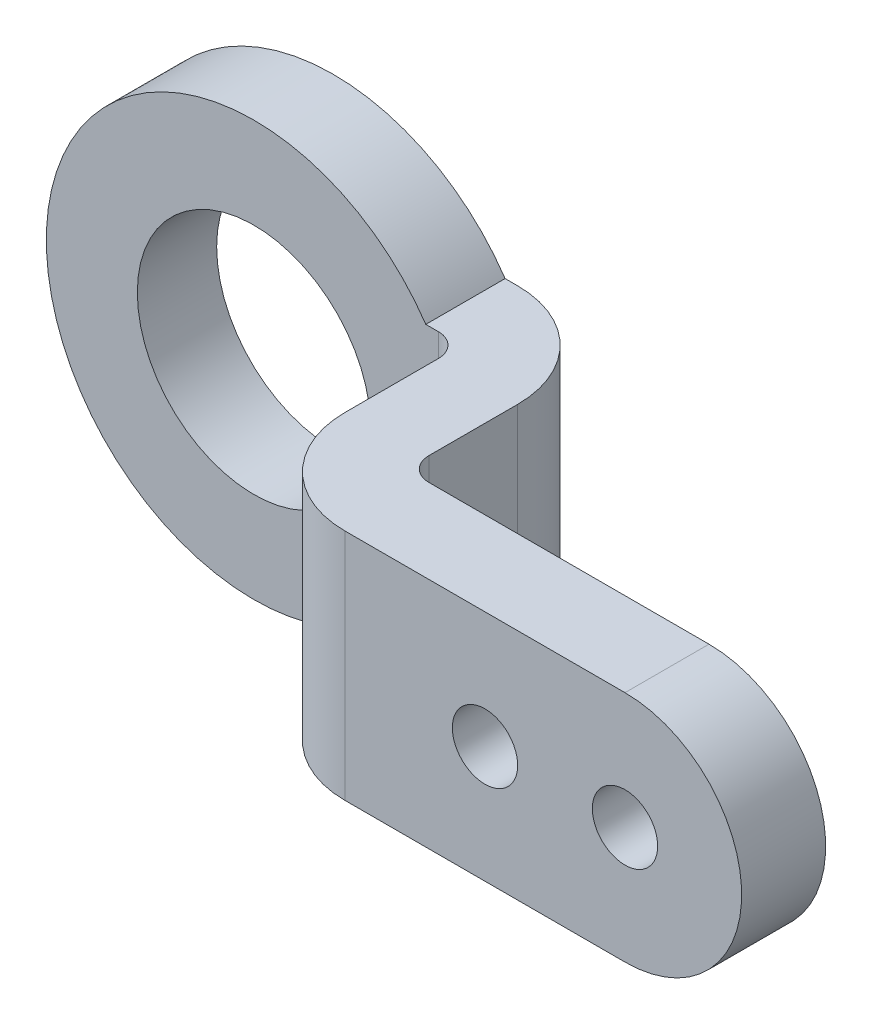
ISO-10303-21;
HEADER;
FILE_DESCRIPTION(('STEP AP214'),'2;1');
FILE_NAME('part.step','',(''),(''),'','','');
FILE_SCHEMA(('AUTOMOTIVE_DESIGN { 1 0 10303 214 1 1 1 1 }'));
ENDSEC;
DATA;
#1=APPLICATION_CONTEXT('core data for automotive mechanical design processes');
#2=APPLICATION_PROTOCOL_DEFINITION('international standard','automotive_design',2000,#1);
#3=PRODUCT_CONTEXT('',#1,'mechanical');
#4=PRODUCT('Part','Part','',(#3));
#5=PRODUCT_RELATED_PRODUCT_CATEGORY('part','',(#4));
#6=PRODUCT_DEFINITION_FORMATION('','',#4);
#7=PRODUCT_DEFINITION_CONTEXT('part definition',#1,'design');
#8=PRODUCT_DEFINITION('design','',#6,#7);
#9=PRODUCT_DEFINITION_SHAPE('','',#8);
#10=(LENGTH_UNIT() NAMED_UNIT(*) SI_UNIT(.MILLI.,.METRE.));
#11=(NAMED_UNIT(*) PLANE_ANGLE_UNIT() SI_UNIT($,.RADIAN.));
#12=(NAMED_UNIT(*) SI_UNIT($,.STERADIAN.) SOLID_ANGLE_UNIT());
#13=UNCERTAINTY_MEASURE_WITH_UNIT(LENGTH_MEASURE(1.E-05),#10,'distance_accuracy_value','');
#14=(GEOMETRIC_REPRESENTATION_CONTEXT(3) GLOBAL_UNCERTAINTY_ASSIGNED_CONTEXT((#13)) GLOBAL_UNIT_ASSIGNED_CONTEXT((#10,
#11,#12)) REPRESENTATION_CONTEXT('',''));
#15=CARTESIAN_POINT('',(0.,0.,0.));
#16=DIRECTION('',(0.,0.,1.));
#17=DIRECTION('',(1.,0.,0.));
#18=AXIS2_PLACEMENT_3D('',#15,#16,#17);
#19=CARTESIAN_POINT('',(-8.2,2.5,-1.8));
#20=DIRECTION('',(-1.,0.,0.));
#21=DIRECTION('',(0.,-1.,0.));
#22=AXIS2_PLACEMENT_3D('',#19,#20,#21);
#23=PLANE('',#22);
#24=DIRECTION('',(0.,0.,1.));
#25=VECTOR('',#24,1.);
#26=CARTESIAN_POINT('',(-8.2,2.5,-1.8));
#27=LINE('',#26,#25);
#28=CARTESIAN_POINT('',(-8.2,2.5,-4.2));
#29=VERTEX_POINT('',#28);
#30=CARTESIAN_POINT('',(-8.2,2.5,-2.2));
#31=VERTEX_POINT('',#30);
#32=EDGE_CURVE('E522',#29,#31,#27,.T.);
#33=ORIENTED_EDGE('',*,*,#32,.F.);
#34=DIRECTION('',(0.,-1.,0.));
#35=VECTOR('',#34,1.);
#36=CARTESIAN_POINT('',(-8.2,2.5,-4.2));
#37=LINE('',#36,#35);
#38=CARTESIAN_POINT('',(-8.2,-2.5,-4.2));
#39=VERTEX_POINT('',#38);
#40=EDGE_CURVE('E549',#29,#39,#37,.T.);
#41=ORIENTED_EDGE('',*,*,#40,.T.);
#42=DIRECTION('',(0.,0.,1.));
#43=VECTOR('',#42,1.);
#44=CARTESIAN_POINT('',(-8.2,-2.5,-1.8));
#45=LINE('',#44,#43);
#46=CARTESIAN_POINT('',(-8.2,-2.5,-2.2));
#47=VERTEX_POINT('',#46);
#48=EDGE_CURVE('E521',#39,#47,#45,.T.);
#49=ORIENTED_EDGE('',*,*,#48,.T.);
#50=DIRECTION('',(0.,-1.,0.));
#51=VECTOR('',#50,1.);
#52=CARTESIAN_POINT('',(-8.2,2.5,-2.2));
#53=LINE('',#52,#51);
#54=EDGE_CURVE('E538',#47,#31,#53,.F.);
#55=ORIENTED_EDGE('',*,*,#54,.T.);
#56=EDGE_LOOP('',(#33,#41,#49,#55));
#57=FACE_BOUND('',#56,.T.);
#58=ADVANCED_FACE('F362',(#57),#23,.T.);
#59=CARTESIAN_POINT('',(-8.2,2.5,-1.8));
#60=DIRECTION('',(0.,1.,0.));
#61=DIRECTION('',(0.,0.,1.));
#62=AXIS2_PLACEMENT_3D('',#59,#60,#61);
#63=PLANE('',#62);
#64=DIRECTION('',(1.,0.,0.));
#65=VECTOR('',#64,1.);
#66=CARTESIAN_POINT('',(-6.5,2.5,-4.7));
#67=LINE('',#66,#65);
#68=CARTESIAN_POINT('',(-8.96862797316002,2.5,-4.7));
#69=VERTEX_POINT('',#68);
#70=CARTESIAN_POINT('',(-8.7,2.5,-4.7));
#71=VERTEX_POINT('',#70);
#72=EDGE_CURVE('E473',#69,#71,#67,.T.);
#73=ORIENTED_EDGE('',*,*,#72,.T.);
#74=CARTESIAN_POINT('',(-8.7,2.5,-4.2));
#75=DIRECTION('',(0.,1.,0.));
#76=DIRECTION('',(0.,0.,1.));
#77=AXIS2_PLACEMENT_3D('',#74,#75,#76);
#78=CIRCLE('',#77,0.5);
#79=EDGE_CURVE('E560',#71,#29,#78,.F.);
#80=ORIENTED_EDGE('',*,*,#79,.T.);
#81=ORIENTED_EDGE('',*,*,#32,.T.);
#82=CARTESIAN_POINT('',(-6.,2.5,-2.2));
#83=DIRECTION('',(0.,1.,0.));
#84=DIRECTION('',(0.,0.,1.));
#85=AXIS2_PLACEMENT_3D('',#82,#83,#84);
#86=CIRCLE('',#85,2.2);
#87=CARTESIAN_POINT('',(-6.,2.5,0.));
#88=VERTEX_POINT('',#87);
#89=EDGE_CURVE('E543',#31,#88,#86,.T.);
#90=ORIENTED_EDGE('',*,*,#89,.T.);
#91=DIRECTION('',(-1.,0.,0.));
#92=VECTOR('',#91,1.);
#93=CARTESIAN_POINT('',(-8.2,2.5,0.));
#94=LINE('',#93,#92);
#95=CARTESIAN_POINT('',(0.,2.5,0.));
#96=VERTEX_POINT('',#95);
#97=EDGE_CURVE('E511',#96,#88,#94,.T.);
#98=ORIENTED_EDGE('',*,*,#97,.F.);
#99=DIRECTION('',(0.,0.,1.));
#100=VECTOR('',#99,1.);
#101=CARTESIAN_POINT('',(0.,2.5,-1.8));
#102=LINE('',#101,#100);
#103=CARTESIAN_POINT('',(0.,2.5,-1.8));
#104=VERTEX_POINT('',#103);
#105=EDGE_CURVE('E525',#104,#96,#102,.T.);
#106=ORIENTED_EDGE('',*,*,#105,.F.);
#107=DIRECTION('',(-1.,0.,0.));
#108=VECTOR('',#107,1.);
#109=CARTESIAN_POINT('',(-8.2,2.5,-1.8));
#110=LINE('',#109,#108);
#111=CARTESIAN_POINT('',(-6.,2.5,-1.8));
#112=VERTEX_POINT('',#111);
#113=EDGE_CURVE('E519',#104,#112,#110,.T.);
#114=ORIENTED_EDGE('',*,*,#113,.T.);
#115=CARTESIAN_POINT('',(-6.,2.5,-2.3));
#116=DIRECTION('',(0.,1.,0.));
#117=DIRECTION('',(0.,0.,1.));
#118=AXIS2_PLACEMENT_3D('',#115,#116,#117);
#119=CIRCLE('',#118,0.5);
#120=CARTESIAN_POINT('',(-6.5,2.5,-2.3));
#121=VERTEX_POINT('',#120);
#122=EDGE_CURVE('E369',#112,#121,#119,.F.);
#123=ORIENTED_EDGE('',*,*,#122,.T.);
#124=DIRECTION('',(0.,0.,-1.));
#125=VECTOR('',#124,1.);
#126=CARTESIAN_POINT('',(-6.5,2.5,0.));
#127=LINE('',#126,#125);
#128=CARTESIAN_POINT('',(-6.5,2.5,-4.2));
#129=VERTEX_POINT('',#128);
#130=EDGE_CURVE('E489',#121,#129,#127,.T.);
#131=ORIENTED_EDGE('',*,*,#130,.T.);
#132=CARTESIAN_POINT('',(-8.7,2.5,-4.2));
#133=DIRECTION('',(0.,1.,0.));
#134=DIRECTION('',(0.,0.,1.));
#135=AXIS2_PLACEMENT_3D('',#132,#133,#134);
#136=CIRCLE('',#135,2.2);
#137=CARTESIAN_POINT('',(-8.7,2.5,-6.4));
#138=VERTEX_POINT('',#137);
#139=EDGE_CURVE('E541',#129,#138,#136,.T.);
#140=ORIENTED_EDGE('',*,*,#139,.T.);
#141=DIRECTION('',(-1.,0.,0.));
#142=VECTOR('',#141,1.);
#143=CARTESIAN_POINT('',(-6.5,2.5,-6.4));
#144=LINE('',#143,#142);
#145=CARTESIAN_POINT('',(-8.96862797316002,2.5,-6.4));
#146=VERTEX_POINT('',#145);
#147=EDGE_CURVE('E461',#138,#146,#144,.T.);
#148=ORIENTED_EDGE('',*,*,#147,.T.);
#149=DIRECTION('',(0.,0.,-1.));
#150=VECTOR('',#149,1.);
#151=CARTESIAN_POINT('',(-8.96862797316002,2.5,-4.7));
#152=LINE('',#151,#150);
#153=EDGE_CURVE('E472',#69,#146,#152,.T.);
#154=ORIENTED_EDGE('',*,*,#153,.F.);
#155=EDGE_LOOP('',(#73,#80,#81,#90,#98,#106,#114,#123,#131,#140,#148,#154));
#156=FACE_BOUND('',#155,.T.);
#157=ADVANCED_FACE('F563',(#156),#63,.T.);
#158=CARTESIAN_POINT('',(0.,0.,-1.8));
#159=DIRECTION('',(0.,0.,1.));
#160=DIRECTION('',(1.,0.,0.));
#161=AXIS2_PLACEMENT_3D('',#158,#159,#160);
#162=CYLINDRICAL_SURFACE('',#161,2.5);
#163=CARTESIAN_POINT('',(0.,0.,0.));
#164=DIRECTION('',(0.,0.,1.));
#165=DIRECTION('',(1.,0.,0.));
#166=AXIS2_PLACEMENT_3D('',#163,#164,#165);
#167=CIRCLE('',#166,2.5);
#168=CARTESIAN_POINT('',(0.,-2.5,0.));
#169=VERTEX_POINT('',#168);
#170=EDGE_CURVE('E508',#169,#96,#167,.T.);
#171=ORIENTED_EDGE('',*,*,#170,.F.);
#172=DIRECTION('',(0.,0.,1.));
#173=VECTOR('',#172,1.);
#174=CARTESIAN_POINT('',(0.,-2.5,-1.8));
#175=LINE('',#174,#173);
#176=CARTESIAN_POINT('',(0.,-2.5,-1.8));
#177=VERTEX_POINT('',#176);
#178=EDGE_CURVE('E527',#177,#169,#175,.T.);
#179=ORIENTED_EDGE('',*,*,#178,.F.);
#180=CARTESIAN_POINT('',(0.,0.,-1.8));
#181=DIRECTION('',(0.,0.,1.));
#182=DIRECTION('',(1.,0.,0.));
#183=AXIS2_PLACEMENT_3D('',#180,#181,#182);
#184=CIRCLE('',#183,2.5);
#185=EDGE_CURVE('E516',#177,#104,#184,.T.);
#186=ORIENTED_EDGE('',*,*,#185,.T.);
#187=ORIENTED_EDGE('',*,*,#105,.T.);
#188=EDGE_LOOP('',(#171,#179,#186,#187));
#189=FACE_BOUND('',#188,.T.);
#190=ADVANCED_FACE('F602',(#189),#162,.T.);
#191=CARTESIAN_POINT('',(-8.2,-2.5,-1.8));
#192=DIRECTION('',(0.,-1.,0.));
#193=DIRECTION('',(0.,0.,-1.));
#194=AXIS2_PLACEMENT_3D('',#191,#192,#193);
#195=PLANE('',#194);
#196=DIRECTION('',(1.,0.,0.));
#197=VECTOR('',#196,1.);
#198=CARTESIAN_POINT('',(-8.2,-2.5,0.));
#199=LINE('',#198,#197);
#200=CARTESIAN_POINT('',(-6.,-2.5,0.));
#201=VERTEX_POINT('',#200);
#202=EDGE_CURVE('E506',#201,#169,#199,.T.);
#203=ORIENTED_EDGE('',*,*,#202,.F.);
#204=CARTESIAN_POINT('',(-6.,-2.5,-2.2));
#205=DIRECTION('',(0.,-1.,0.));
#206=DIRECTION('',(0.,0.,-1.));
#207=AXIS2_PLACEMENT_3D('',#204,#205,#206);
#208=CIRCLE('',#207,2.2);
#209=EDGE_CURVE('E535',#201,#47,#208,.T.);
#210=ORIENTED_EDGE('',*,*,#209,.T.);
#211=ORIENTED_EDGE('',*,*,#48,.F.);
#212=CARTESIAN_POINT('',(-8.7,-2.5,-4.2));
#213=DIRECTION('',(0.,-1.,0.));
#214=DIRECTION('',(0.,0.,-1.));
#215=AXIS2_PLACEMENT_3D('',#212,#213,#214);
#216=CIRCLE('',#215,0.5);
#217=CARTESIAN_POINT('',(-8.7,-2.5,-4.7));
#218=VERTEX_POINT('',#217);
#219=EDGE_CURVE('E558',#39,#218,#216,.F.);
#220=ORIENTED_EDGE('',*,*,#219,.T.);
#221=DIRECTION('',(-1.,0.,0.));
#222=VECTOR('',#221,1.);
#223=CARTESIAN_POINT('',(-6.5,-2.5,-4.7));
#224=LINE('',#223,#222);
#225=CARTESIAN_POINT('',(-8.96862797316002,-2.5,-4.7));
#226=VERTEX_POINT('',#225);
#227=EDGE_CURVE('E468',#218,#226,#224,.T.);
#228=ORIENTED_EDGE('',*,*,#227,.T.);
#229=DIRECTION('',(0.,0.,-1.));
#230=VECTOR('',#229,1.);
#231=CARTESIAN_POINT('',(-8.96862797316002,-2.5,-4.7));
#232=LINE('',#231,#230);
#233=CARTESIAN_POINT('',(-8.96862797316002,-2.5,-6.4));
#234=VERTEX_POINT('',#233);
#235=EDGE_CURVE('E464',#226,#234,#232,.T.);
#236=ORIENTED_EDGE('',*,*,#235,.T.);
#237=DIRECTION('',(-1.,0.,0.));
#238=VECTOR('',#237,1.);
#239=CARTESIAN_POINT('',(-6.5,-2.5,-6.4));
#240=LINE('',#239,#238);
#241=CARTESIAN_POINT('',(-8.7,-2.5,-6.4));
#242=VERTEX_POINT('',#241);
#243=EDGE_CURVE('E450',#242,#234,#240,.T.);
#244=ORIENTED_EDGE('',*,*,#243,.F.);
#245=CARTESIAN_POINT('',(-8.7,-2.5,-4.2));
#246=DIRECTION('',(0.,-1.,0.));
#247=DIRECTION('',(0.,0.,-1.));
#248=AXIS2_PLACEMENT_3D('',#245,#246,#247);
#249=CIRCLE('',#248,2.2);
#250=CARTESIAN_POINT('',(-6.5,-2.5,-4.2));
#251=VERTEX_POINT('',#250);
#252=EDGE_CURVE('E533',#242,#251,#249,.T.);
#253=ORIENTED_EDGE('',*,*,#252,.T.);
#254=DIRECTION('',(0.,0.,1.));
#255=VECTOR('',#254,1.);
#256=CARTESIAN_POINT('',(-6.5,-2.5,0.));
#257=LINE('',#256,#255);
#258=CARTESIAN_POINT('',(-6.5,-2.5,-2.3));
#259=VERTEX_POINT('',#258);
#260=EDGE_CURVE('E492',#251,#259,#257,.T.);
#261=ORIENTED_EDGE('',*,*,#260,.T.);
#262=CARTESIAN_POINT('',(-6.,-2.5,-2.3));
#263=DIRECTION('',(0.,-1.,0.));
#264=DIRECTION('',(0.,0.,-1.));
#265=AXIS2_PLACEMENT_3D('',#262,#263,#264);
#266=CIRCLE('',#265,0.5);
#267=CARTESIAN_POINT('',(-6.,-2.5,-1.8));
#268=VERTEX_POINT('',#267);
#269=EDGE_CURVE('E11',#259,#268,#266,.F.);
#270=ORIENTED_EDGE('',*,*,#269,.T.);
#271=DIRECTION('',(1.,0.,0.));
#272=VECTOR('',#271,1.);
#273=CARTESIAN_POINT('',(-8.2,-2.5,-1.8));
#274=LINE('',#273,#272);
#275=EDGE_CURVE('E514',#268,#177,#274,.T.);
#276=ORIENTED_EDGE('',*,*,#275,.T.);
#277=ORIENTED_EDGE('',*,*,#178,.T.);
#278=EDGE_LOOP('',(#203,#210,#211,#220,#228,#236,#244,#253,#261,#270,#276,#277));
#279=FACE_BOUND('',#278,.T.);
#280=ADVANCED_FACE('F466',(#279),#195,.T.);
#281=CARTESIAN_POINT('',(0.,0.,-1.8));
#282=DIRECTION('',(0.,0.,1.));
#283=DIRECTION('',(1.,0.,0.));
#284=AXIS2_PLACEMENT_3D('',#281,#282,#283);
#285=PLANE('',#284);
#286=CARTESIAN_POINT('',(-3.,0.,-1.8));
#287=DIRECTION('',(0.,0.,1.));
#288=DIRECTION('',(1.,0.,0.));
#289=AXIS2_PLACEMENT_3D('',#286,#287,#288);
#290=CIRCLE('',#289,0.7);
#291=CARTESIAN_POINT('',(-2.3,0.,-1.8));
#292=VERTEX_POINT('',#291);
#293=EDGE_CURVE('E497',#292,#292,#290,.T.);
#294=ORIENTED_EDGE('',*,*,#293,.T.);
#295=EDGE_LOOP('',(#294));
#296=FACE_BOUND('',#295,.T.);
#297=CARTESIAN_POINT('',(0.,0.,-1.8));
#298=DIRECTION('',(0.,0.,1.));
#299=DIRECTION('',(1.,0.,0.));
#300=AXIS2_PLACEMENT_3D('',#297,#298,#299);
#301=CIRCLE('',#300,0.7);
#302=CARTESIAN_POINT('',(0.7,0.,-1.8));
#303=VERTEX_POINT('',#302);
#304=EDGE_CURVE('E503',#303,#303,#301,.T.);
#305=ORIENTED_EDGE('',*,*,#304,.T.);
#306=EDGE_LOOP('',(#305));
#307=FACE_BOUND('',#306,.T.);
#308=ORIENTED_EDGE('',*,*,#275,.F.);
#309=DIRECTION('',(0.,1.,0.));
#310=VECTOR('',#309,1.);
#311=CARTESIAN_POINT('',(-6.,0.,-1.8));
#312=LINE('',#311,#310);
#313=EDGE_CURVE('E554',#268,#112,#312,.T.);
#314=ORIENTED_EDGE('',*,*,#313,.T.);
#315=ORIENTED_EDGE('',*,*,#113,.F.);
#316=ORIENTED_EDGE('',*,*,#185,.F.);
#317=EDGE_LOOP('',(#308,#314,#315,#316));
#318=FACE_BOUND('',#317,.T.);
#319=ADVANCED_FACE('F610',(#296,#307,#318),#285,.F.);
#320=CARTESIAN_POINT('',(0.,0.,0.));
#321=DIRECTION('',(0.,0.,1.));
#322=DIRECTION('',(1.,0.,0.));
#323=AXIS2_PLACEMENT_3D('',#320,#321,#322);
#324=PLANE('',#323);
#325=ORIENTED_EDGE('',*,*,#97,.T.);
#326=DIRECTION('',(0.,-1.,0.));
#327=VECTOR('',#326,1.);
#328=CARTESIAN_POINT('',(-6.,0.,0.));
#329=LINE('',#328,#327);
#330=EDGE_CURVE('E524',#88,#201,#329,.T.);
#331=ORIENTED_EDGE('',*,*,#330,.T.);
#332=ORIENTED_EDGE('',*,*,#202,.T.);
#333=ORIENTED_EDGE('',*,*,#170,.T.);
#334=EDGE_LOOP('',(#325,#331,#332,#333));
#335=FACE_BOUND('',#334,.T.);
#336=CARTESIAN_POINT('',(-3.,0.,0.));
#337=DIRECTION('',(0.,0.,1.));
#338=DIRECTION('',(1.,0.,0.));
#339=AXIS2_PLACEMENT_3D('',#336,#337,#338);
#340=CIRCLE('',#339,0.7);
#341=CARTESIAN_POINT('',(-2.3,0.,0.));
#342=VERTEX_POINT('',#341);
#343=EDGE_CURVE('E460',#342,#342,#340,.T.);
#344=ORIENTED_EDGE('',*,*,#343,.F.);
#345=EDGE_LOOP('',(#344));
#346=FACE_BOUND('',#345,.T.);
#347=CARTESIAN_POINT('',(0.,0.,0.));
#348=DIRECTION('',(0.,0.,1.));
#349=DIRECTION('',(1.,0.,0.));
#350=AXIS2_PLACEMENT_3D('',#347,#348,#349);
#351=CIRCLE('',#350,0.7);
#352=CARTESIAN_POINT('',(0.7,0.,0.));
#353=VERTEX_POINT('',#352);
#354=EDGE_CURVE('E500',#353,#353,#351,.T.);
#355=ORIENTED_EDGE('',*,*,#354,.F.);
#356=EDGE_LOOP('',(#355));
#357=FACE_BOUND('',#356,.T.);
#358=ADVANCED_FACE('F616',(#335,#346,#357),#324,.T.);
#359=CARTESIAN_POINT('',(0.,0.,-1.8));
#360=DIRECTION('',(0.,0.,1.));
#361=DIRECTION('',(1.,0.,0.));
#362=AXIS2_PLACEMENT_3D('',#359,#360,#361);
#363=CYLINDRICAL_SURFACE('',#362,0.7);
#364=ORIENTED_EDGE('',*,*,#304,.F.);
#365=EDGE_LOOP('',(#364));
#366=FACE_BOUND('',#365,.T.);
#367=ORIENTED_EDGE('',*,*,#354,.T.);
#368=EDGE_LOOP('',(#367));
#369=FACE_BOUND('',#368,.T.);
#370=ADVANCED_FACE('F621',(#366,#369),#363,.F.);
#371=CARTESIAN_POINT('',(-3.,0.,-1.8));
#372=DIRECTION('',(0.,0.,1.));
#373=DIRECTION('',(1.,0.,0.));
#374=AXIS2_PLACEMENT_3D('',#371,#372,#373);
#375=CYLINDRICAL_SURFACE('',#374,0.7);
#376=ORIENTED_EDGE('',*,*,#293,.F.);
#377=EDGE_LOOP('',(#376));
#378=FACE_BOUND('',#377,.T.);
#379=ORIENTED_EDGE('',*,*,#343,.T.);
#380=EDGE_LOOP('',(#379));
#381=FACE_BOUND('',#380,.T.);
#382=ADVANCED_FACE('F595',(#378,#381),#375,.F.);
#383=CARTESIAN_POINT('',(-6.5,-2.5,0.));
#384=DIRECTION('',(1.,0.,0.));
#385=DIRECTION('',(0.,1.,0.));
#386=AXIS2_PLACEMENT_3D('',#383,#384,#385);
#387=PLANE('',#386);
#388=ORIENTED_EDGE('',*,*,#130,.F.);
#389=DIRECTION('',(0.,1.,0.));
#390=VECTOR('',#389,1.);
#391=CARTESIAN_POINT('',(-6.5,-2.5,-2.3));
#392=LINE('',#391,#390);
#393=EDGE_CURVE('E382',#121,#259,#392,.F.);
#394=ORIENTED_EDGE('',*,*,#393,.T.);
#395=ORIENTED_EDGE('',*,*,#260,.F.);
#396=DIRECTION('',(0.,-1.,0.));
#397=VECTOR('',#396,1.);
#398=CARTESIAN_POINT('',(-6.5,-2.5,-4.2));
#399=LINE('',#398,#397);
#400=EDGE_CURVE('E546',#251,#129,#399,.F.);
#401=ORIENTED_EDGE('',*,*,#400,.T.);
#402=EDGE_LOOP('',(#388,#394,#395,#401));
#403=FACE_BOUND('',#402,.T.);
#404=ADVANCED_FACE('F588',(#403),#387,.T.);
#405=CARTESIAN_POINT('',(-6.5,2.5,-6.4));
#406=DIRECTION('',(0.,0.,-1.));
#407=DIRECTION('',(-1.,0.,0.));
#408=AXIS2_PLACEMENT_3D('',#405,#406,#407);
#409=PLANE('',#408);
#410=ORIENTED_EDGE('',*,*,#147,.F.);
#411=DIRECTION('',(0.,-1.,0.));
#412=VECTOR('',#411,1.);
#413=CARTESIAN_POINT('',(-8.7,2.5,-6.4));
#414=LINE('',#413,#412);
#415=EDGE_CURVE('E458',#138,#242,#414,.T.);
#416=ORIENTED_EDGE('',*,*,#415,.T.);
#417=ORIENTED_EDGE('',*,*,#243,.T.);
#418=CARTESIAN_POINT('',(-12.65,0.,-6.4));
#419=DIRECTION('',(0.,0.,-1.));
#420=DIRECTION('',(-1.,0.,0.));
#421=AXIS2_PLACEMENT_3D('',#418,#419,#420);
#422=CIRCLE('',#421,4.44999999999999);
#423=EDGE_CURVE('E456',#234,#146,#422,.T.);
#424=ORIENTED_EDGE('',*,*,#423,.T.);
#425=EDGE_LOOP('',(#410,#416,#417,#424));
#426=FACE_BOUND('',#425,.T.);
#427=CARTESIAN_POINT('',(-12.65,0.,-6.4));
#428=DIRECTION('',(0.,0.,-1.));
#429=DIRECTION('',(-1.,0.,0.));
#430=AXIS2_PLACEMENT_3D('',#427,#428,#429);
#431=CIRCLE('',#430,2.5);
#432=CARTESIAN_POINT('',(-15.15,0.,-6.4));
#433=VERTEX_POINT('',#432);
#434=EDGE_CURVE('E482',#433,#433,#431,.T.);
#435=ORIENTED_EDGE('',*,*,#434,.F.);
#436=EDGE_LOOP('',(#435));
#437=FACE_BOUND('',#436,.T.);
#438=ADVANCED_FACE('F453',(#426,#437),#409,.T.);
#439=CARTESIAN_POINT('',(-12.65,0.,-4.7));
#440=DIRECTION('',(0.,0.,-1.));
#441=DIRECTION('',(-1.,0.,0.));
#442=AXIS2_PLACEMENT_3D('',#439,#440,#441);
#443=CYLINDRICAL_SURFACE('',#442,4.44999999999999);
#444=ORIENTED_EDGE('',*,*,#423,.F.);
#445=ORIENTED_EDGE('',*,*,#235,.F.);
#446=CARTESIAN_POINT('',(-12.65,0.,-4.7));
#447=DIRECTION('',(0.,0.,-1.));
#448=DIRECTION('',(-1.,0.,0.));
#449=AXIS2_PLACEMENT_3D('',#446,#447,#448);
#450=CIRCLE('',#449,4.44999999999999);
#451=EDGE_CURVE('E479',#226,#69,#450,.T.);
#452=ORIENTED_EDGE('',*,*,#451,.T.);
#453=ORIENTED_EDGE('',*,*,#153,.T.);
#454=EDGE_LOOP('',(#444,#445,#452,#453));
#455=FACE_BOUND('',#454,.T.);
#456=ADVANCED_FACE('F476',(#455),#443,.T.);
#457=CARTESIAN_POINT('',(-12.65,0.,-4.7));
#458=DIRECTION('',(0.,0.,-1.));
#459=DIRECTION('',(-1.,0.,0.));
#460=AXIS2_PLACEMENT_3D('',#457,#458,#459);
#461=PLANE('',#460);
#462=ORIENTED_EDGE('',*,*,#227,.F.);
#463=DIRECTION('',(0.,-1.,0.));
#464=VECTOR('',#463,1.);
#465=CARTESIAN_POINT('',(-8.7,0.,-4.7));
#466=LINE('',#465,#464);
#467=EDGE_CURVE('E552',#218,#71,#466,.F.);
#468=ORIENTED_EDGE('',*,*,#467,.T.);
#469=ORIENTED_EDGE('',*,*,#72,.F.);
#470=ORIENTED_EDGE('',*,*,#451,.F.);
#471=EDGE_LOOP('',(#462,#468,#469,#470));
#472=FACE_BOUND('',#471,.T.);
#473=CARTESIAN_POINT('',(-12.65,0.,-4.7));
#474=DIRECTION('',(0.,0.,-1.));
#475=DIRECTION('',(-1.,0.,0.));
#476=AXIS2_PLACEMENT_3D('',#473,#474,#475);
#477=CIRCLE('',#476,2.5);
#478=CARTESIAN_POINT('',(-15.15,0.,-4.7));
#479=VERTEX_POINT('',#478);
#480=EDGE_CURVE('E477',#479,#479,#477,.T.);
#481=ORIENTED_EDGE('',*,*,#480,.T.);
#482=EDGE_LOOP('',(#481));
#483=FACE_BOUND('',#482,.T.);
#484=ADVANCED_FACE('F574',(#472,#483),#461,.F.);
#485=CARTESIAN_POINT('',(-12.65,0.,-4.7));
#486=DIRECTION('',(0.,0.,-1.));
#487=DIRECTION('',(-1.,0.,0.));
#488=AXIS2_PLACEMENT_3D('',#485,#486,#487);
#489=CYLINDRICAL_SURFACE('',#488,2.5);
#490=ORIENTED_EDGE('',*,*,#480,.F.);
#491=EDGE_LOOP('',(#490));
#492=FACE_BOUND('',#491,.T.);
#493=ORIENTED_EDGE('',*,*,#434,.T.);
#494=EDGE_LOOP('',(#493));
#495=FACE_BOUND('',#494,.T.);
#496=ADVANCED_FACE('F577',(#492,#495),#489,.F.);
#497=CARTESIAN_POINT('',(-6.,0.,-2.2));
#498=DIRECTION('',(0.,-1.,0.));
#499=DIRECTION('',(1.,0.,0.));
#500=AXIS2_PLACEMENT_3D('',#497,#498,#499);
#501=CYLINDRICAL_SURFACE('',#500,2.2);
#502=ORIENTED_EDGE('',*,*,#89,.F.);
#503=ORIENTED_EDGE('',*,*,#54,.F.);
#504=ORIENTED_EDGE('',*,*,#209,.F.);
#505=ORIENTED_EDGE('',*,*,#330,.F.);
#506=EDGE_LOOP('',(#502,#503,#504,#505));
#507=FACE_BOUND('',#506,.T.);
#508=ADVANCED_FACE('F583',(#507),#501,.T.);
#509=CARTESIAN_POINT('',(-8.7,2.5,-4.2));
#510=DIRECTION('',(0.,-1.,0.));
#511=DIRECTION('',(1.,0.,0.));
#512=AXIS2_PLACEMENT_3D('',#509,#510,#511);
#513=CYLINDRICAL_SURFACE('',#512,2.2);
#514=ORIENTED_EDGE('',*,*,#139,.F.);
#515=ORIENTED_EDGE('',*,*,#400,.F.);
#516=ORIENTED_EDGE('',*,*,#252,.F.);
#517=ORIENTED_EDGE('',*,*,#415,.F.);
#518=EDGE_LOOP('',(#514,#515,#516,#517));
#519=FACE_BOUND('',#518,.T.);
#520=ADVANCED_FACE('F638',(#519),#513,.T.);
#521=CARTESIAN_POINT('',(-8.7,2.5,-4.2));
#522=DIRECTION('',(0.,-1.,0.));
#523=DIRECTION('',(1.,0.,0.));
#524=AXIS2_PLACEMENT_3D('',#521,#522,#523);
#525=CYLINDRICAL_SURFACE('',#524,0.5);
#526=ORIENTED_EDGE('',*,*,#79,.F.);
#527=ORIENTED_EDGE('',*,*,#467,.F.);
#528=ORIENTED_EDGE('',*,*,#219,.F.);
#529=ORIENTED_EDGE('',*,*,#40,.F.);
#530=EDGE_LOOP('',(#526,#527,#528,#529));
#531=FACE_BOUND('',#530,.T.);
#532=ADVANCED_FACE('F572',(#531),#525,.F.);
#533=CARTESIAN_POINT('',(-6.,0.,-2.3));
#534=DIRECTION('',(0.,1.,0.));
#535=DIRECTION('',(-1.,0.,0.));
#536=AXIS2_PLACEMENT_3D('',#533,#534,#535);
#537=CYLINDRICAL_SURFACE('',#536,0.5);
#538=ORIENTED_EDGE('',*,*,#269,.F.);
#539=ORIENTED_EDGE('',*,*,#393,.F.);
#540=ORIENTED_EDGE('',*,*,#122,.F.);
#541=ORIENTED_EDGE('',*,*,#313,.F.);
#542=EDGE_LOOP('',(#538,#539,#540,#541));
#543=FACE_BOUND('',#542,.T.);
#544=ADVANCED_FACE('F634',(#543),#537,.F.);
#545=CLOSED_SHELL('',(#58,#157,#190,#280,#319,#358,#370,#382,#404,#438,#456,#484,#496,#508,#520,
#532,#544));
#546=MANIFOLD_SOLID_BREP('B2',#545);
#547=ADVANCED_BREP_SHAPE_REPRESENTATION('',(#18,#546),#14);
#548=SHAPE_DEFINITION_REPRESENTATION(#9,#547);
ENDSEC;
END-ISO-10303-21;
